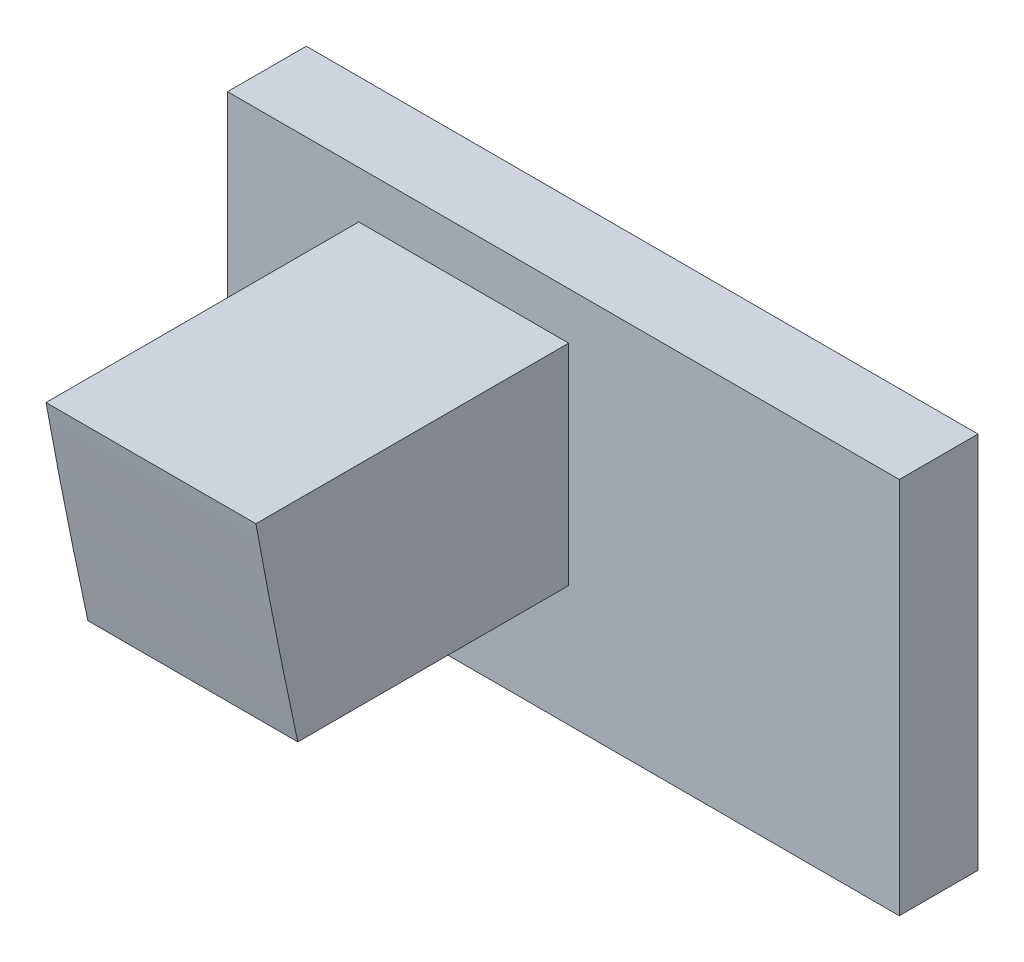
ISO-10303-21;
HEADER;
FILE_DESCRIPTION(('STEP AP214'),'2;1');
FILE_NAME('part.step','',(''),(''),'','','');
FILE_SCHEMA(('AUTOMOTIVE_DESIGN { 1 0 10303 214 1 1 1 1 }'));
ENDSEC;
DATA;
#1=APPLICATION_CONTEXT('core data for automotive mechanical design processes');
#2=APPLICATION_PROTOCOL_DEFINITION('international standard','automotive_design',2000,#1);
#3=PRODUCT_CONTEXT('',#1,'mechanical');
#4=PRODUCT('Part','Part','',(#3));
#5=PRODUCT_RELATED_PRODUCT_CATEGORY('part','',(#4));
#6=PRODUCT_DEFINITION_FORMATION('','',#4);
#7=PRODUCT_DEFINITION_CONTEXT('part definition',#1,'design');
#8=PRODUCT_DEFINITION('design','',#6,#7);
#9=PRODUCT_DEFINITION_SHAPE('','',#8);
#10=(LENGTH_UNIT() NAMED_UNIT(*) SI_UNIT(.MILLI.,.METRE.));
#11=(NAMED_UNIT(*) PLANE_ANGLE_UNIT() SI_UNIT($,.RADIAN.));
#12=(NAMED_UNIT(*) SI_UNIT($,.STERADIAN.) SOLID_ANGLE_UNIT());
#13=UNCERTAINTY_MEASURE_WITH_UNIT(LENGTH_MEASURE(1.E-05),#10,'distance_accuracy_value','');
#14=(GEOMETRIC_REPRESENTATION_CONTEXT(3) GLOBAL_UNCERTAINTY_ASSIGNED_CONTEXT((#13)) GLOBAL_UNIT_ASSIGNED_CONTEXT((#10,
#11,#12)) REPRESENTATION_CONTEXT('',''));
#15=CARTESIAN_POINT('',(0.,0.,0.));
#16=DIRECTION('',(0.,0.,1.));
#17=DIRECTION('',(1.,0.,0.));
#18=AXIS2_PLACEMENT_3D('',#15,#16,#17);
#19=CARTESIAN_POINT('',(0.,7.2,-500000.));
#20=DIRECTION('',(-1.,0.,0.));
#21=DIRECTION('',(0.,-1.,0.));
#22=AXIS2_PLACEMENT_3D('',#19,#20,#21);
#23=PLANE('',#22);
#24=DIRECTION('',(0.,0.,1.));
#25=VECTOR('',#24,1.);
#26=CARTESIAN_POINT('',(0.,0.,-500000.));
#27=LINE('',#26,#25);
#28=CARTESIAN_POINT('',(0.,0.,0.));
#29=VERTEX_POINT('',#28);
#30=CARTESIAN_POINT('',(0.,0.,1.49999999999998));
#31=VERTEX_POINT('',#30);
#32=EDGE_CURVE('E220',#29,#31,#27,.T.);
#33=ORIENTED_EDGE('',*,*,#32,.T.);
#34=DIRECTION('',(0.,1.,0.));
#35=VECTOR('',#34,1.);
#36=CARTESIAN_POINT('',(0.,7.2,1.49999999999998));
#37=LINE('',#36,#35);
#38=CARTESIAN_POINT('',(0.,7.2,1.49999999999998));
#39=VERTEX_POINT('',#38);
#40=EDGE_CURVE('E166',#31,#39,#37,.T.);
#41=ORIENTED_EDGE('',*,*,#40,.T.);
#42=DIRECTION('',(0.,0.,1.));
#43=VECTOR('',#42,1.);
#44=CARTESIAN_POINT('',(0.,7.2,-500000.));
#45=LINE('',#44,#43);
#46=CARTESIAN_POINT('',(0.,7.2,0.));
#47=VERTEX_POINT('',#46);
#48=EDGE_CURVE('E223',#47,#39,#45,.T.);
#49=ORIENTED_EDGE('',*,*,#48,.F.);
#50=DIRECTION('',(0.,1.,0.));
#51=VECTOR('',#50,1.);
#52=CARTESIAN_POINT('',(0.,7.2,0.));
#53=LINE('',#52,#51);
#54=EDGE_CURVE('E231',#29,#47,#53,.T.);
#55=ORIENTED_EDGE('',*,*,#54,.F.);
#56=EDGE_LOOP('',(#33,#41,#49,#55));
#57=FACE_BOUND('',#56,.T.);
#58=ADVANCED_FACE('F30',(#57),#23,.T.);
#59=CARTESIAN_POINT('',(0.,0.,-500000.));
#60=DIRECTION('',(0.,-1.,0.));
#61=DIRECTION('',(0.,0.,-1.));
#62=AXIS2_PLACEMENT_3D('',#59,#60,#61);
#63=PLANE('',#62);
#64=DIRECTION('',(0.,0.,1.));
#65=VECTOR('',#64,1.);
#66=CARTESIAN_POINT('',(12.8,0.,-500000.));
#67=LINE('',#66,#65);
#68=CARTESIAN_POINT('',(12.8,0.,0.));
#69=VERTEX_POINT('',#68);
#70=CARTESIAN_POINT('',(12.8,0.,1.50000000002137));
#71=VERTEX_POINT('',#70);
#72=EDGE_CURVE('E217',#69,#71,#67,.T.);
#73=ORIENTED_EDGE('',*,*,#72,.T.);
#74=DIRECTION('',(-1.,0.,0.));
#75=VECTOR('',#74,1.);
#76=CARTESIAN_POINT('',(0.,0.,1.49999999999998));
#77=LINE('',#76,#75);
#78=EDGE_CURVE('E169',#71,#31,#77,.T.);
#79=ORIENTED_EDGE('',*,*,#78,.T.);
#80=ORIENTED_EDGE('',*,*,#32,.F.);
#81=DIRECTION('',(-1.,0.,0.));
#82=VECTOR('',#81,1.);
#83=CARTESIAN_POINT('',(0.,0.,0.));
#84=LINE('',#83,#82);
#85=EDGE_CURVE('E229',#69,#29,#84,.T.);
#86=ORIENTED_EDGE('',*,*,#85,.F.);
#87=EDGE_LOOP('',(#73,#79,#80,#86));
#88=FACE_BOUND('',#87,.T.);
#89=ADVANCED_FACE('F245',(#88),#63,.T.);
#90=CARTESIAN_POINT('',(12.8,7.2,-500000.));
#91=DIRECTION('',(0.,1.,0.));
#92=DIRECTION('',(0.,0.,1.));
#93=AXIS2_PLACEMENT_3D('',#90,#91,#92);
#94=PLANE('',#93);
#95=ORIENTED_EDGE('',*,*,#48,.T.);
#96=DIRECTION('',(1.,0.,0.));
#97=VECTOR('',#96,1.);
#98=CARTESIAN_POINT('',(12.8,7.2,1.49999999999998));
#99=LINE('',#98,#97);
#100=CARTESIAN_POINT('',(12.8,7.2,1.49999999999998));
#101=VERTEX_POINT('',#100);
#102=EDGE_CURVE('E157',#39,#101,#99,.T.);
#103=ORIENTED_EDGE('',*,*,#102,.T.);
#104=DIRECTION('',(0.,0.,1.));
#105=VECTOR('',#104,1.);
#106=CARTESIAN_POINT('',(12.8,7.2,-500000.));
#107=LINE('',#106,#105);
#108=CARTESIAN_POINT('',(12.8,7.2,0.));
#109=VERTEX_POINT('',#108);
#110=EDGE_CURVE('E165',#109,#101,#107,.T.);
#111=ORIENTED_EDGE('',*,*,#110,.F.);
#112=DIRECTION('',(1.,0.,0.));
#113=VECTOR('',#112,1.);
#114=CARTESIAN_POINT('',(12.8,7.2,0.));
#115=LINE('',#114,#113);
#116=EDGE_CURVE('E226',#47,#109,#115,.T.);
#117=ORIENTED_EDGE('',*,*,#116,.F.);
#118=EDGE_LOOP('',(#95,#103,#111,#117));
#119=FACE_BOUND('',#118,.T.);
#120=ADVANCED_FACE('F32',(#119),#94,.T.);
#121=CARTESIAN_POINT('',(12.8,0.,-500000.));
#122=DIRECTION('',(1.,0.,0.));
#123=DIRECTION('',(0.,1.,0.));
#124=AXIS2_PLACEMENT_3D('',#121,#122,#123);
#125=PLANE('',#124);
#126=ORIENTED_EDGE('',*,*,#110,.T.);
#127=DIRECTION('',(0.,-1.,0.));
#128=VECTOR('',#127,1.);
#129=CARTESIAN_POINT('',(12.8,0.,1.49999999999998));
#130=LINE('',#129,#128);
#131=EDGE_CURVE('E162',#101,#71,#130,.T.);
#132=ORIENTED_EDGE('',*,*,#131,.T.);
#133=ORIENTED_EDGE('',*,*,#72,.F.);
#134=DIRECTION('',(0.,-1.,0.));
#135=VECTOR('',#134,1.);
#136=CARTESIAN_POINT('',(12.8,0.,0.));
#137=LINE('',#136,#135);
#138=EDGE_CURVE('E214',#109,#69,#137,.T.);
#139=ORIENTED_EDGE('',*,*,#138,.F.);
#140=EDGE_LOOP('',(#126,#132,#133,#139));
#141=FACE_BOUND('',#140,.T.);
#142=ADVANCED_FACE('F243',(#141),#125,.T.);
#143=CARTESIAN_POINT('',(0.,7.2,0.));
#144=DIRECTION('',(0.,0.,1.));
#145=DIRECTION('',(1.,0.,0.));
#146=AXIS2_PLACEMENT_3D('',#143,#144,#145);
#147=PLANE('',#146);
#148=ORIENTED_EDGE('',*,*,#54,.T.);
#149=ORIENTED_EDGE('',*,*,#116,.T.);
#150=ORIENTED_EDGE('',*,*,#138,.T.);
#151=ORIENTED_EDGE('',*,*,#85,.T.);
#152=EDGE_LOOP('',(#148,#149,#150,#151));
#153=FACE_BOUND('',#152,.T.);
#154=DIRECTION('',(-1.,0.,0.));
#155=VECTOR('',#154,1.);
#156=CARTESIAN_POINT('',(6.,2.8,0.));
#157=LINE('',#156,#155);
#158=CARTESIAN_POINT('',(6.,2.8,0.));
#159=VERTEX_POINT('',#158);
#160=CARTESIAN_POINT('',(3.,2.8,0.));
#161=VERTEX_POINT('',#160);
#162=EDGE_CURVE('E38',#159,#161,#157,.T.);
#163=ORIENTED_EDGE('',*,*,#162,.F.);
#164=DIRECTION('',(0.,1.,0.));
#165=VECTOR('',#164,1.);
#166=CARTESIAN_POINT('',(6.,2.8,0.));
#167=LINE('',#166,#165);
#168=CARTESIAN_POINT('',(6.,5.8,0.));
#169=VERTEX_POINT('',#168);
#170=EDGE_CURVE('E187',#159,#169,#167,.T.);
#171=ORIENTED_EDGE('',*,*,#170,.T.);
#172=DIRECTION('',(1.,0.,0.));
#173=VECTOR('',#172,1.);
#174=CARTESIAN_POINT('',(3.,5.8,0.));
#175=LINE('',#174,#173);
#176=CARTESIAN_POINT('',(3.,5.8,0.));
#177=VERTEX_POINT('',#176);
#178=EDGE_CURVE('E185',#177,#169,#175,.T.);
#179=ORIENTED_EDGE('',*,*,#178,.F.);
#180=DIRECTION('',(0.,-1.,0.));
#181=VECTOR('',#180,1.);
#182=CARTESIAN_POINT('',(3.,5.8,0.));
#183=LINE('',#182,#181);
#184=EDGE_CURVE('E182',#177,#161,#183,.T.);
#185=ORIENTED_EDGE('',*,*,#184,.T.);
#186=EDGE_LOOP('',(#163,#171,#179,#185));
#187=FACE_BOUND('',#186,.T.);
#188=ADVANCED_FACE('F236',(#153,#187),#147,.F.);
#189=CARTESIAN_POINT('',(6.,2.8,4.49999999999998));
#190=DIRECTION('',(0.,-1.,0.));
#191=DIRECTION('',(1.,0.,0.));
#192=AXIS2_PLACEMENT_3D('',#189,#190,#191);
#193=PLANE('',#192);
#194=ORIENTED_EDGE('',*,*,#162,.T.);
#195=DIRECTION('',(0.,0.,-1.));
#196=VECTOR('',#195,1.);
#197=CARTESIAN_POINT('',(3.,2.8,4.49999999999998));
#198=LINE('',#197,#196);
#199=CARTESIAN_POINT('',(3.,2.8,4.49999999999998));
#200=VERTEX_POINT('',#199);
#201=EDGE_CURVE('E196',#200,#161,#198,.T.);
#202=ORIENTED_EDGE('',*,*,#201,.F.);
#203=DIRECTION('',(-1.,0.,0.));
#204=VECTOR('',#203,1.);
#205=CARTESIAN_POINT('',(6.,2.8,4.49999999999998));
#206=LINE('',#205,#204);
#207=CARTESIAN_POINT('',(6.,2.8,4.49999999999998));
#208=VERTEX_POINT('',#207);
#209=EDGE_CURVE('E193',#208,#200,#206,.T.);
#210=ORIENTED_EDGE('',*,*,#209,.F.);
#211=DIRECTION('',(0.,0.,-1.));
#212=VECTOR('',#211,1.);
#213=CARTESIAN_POINT('',(6.,2.8,4.49999999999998));
#214=LINE('',#213,#212);
#215=EDGE_CURVE('E190',#208,#159,#214,.T.);
#216=ORIENTED_EDGE('',*,*,#215,.T.);
#217=EDGE_LOOP('',(#194,#202,#210,#216));
#218=FACE_BOUND('',#217,.T.);
#219=ADVANCED_FACE('F280',(#218),#193,.F.);
#220=CARTESIAN_POINT('',(3.,5.8,4.49999999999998));
#221=DIRECTION('',(1.,0.,0.));
#222=DIRECTION('',(0.,1.,0.));
#223=AXIS2_PLACEMENT_3D('',#220,#221,#222);
#224=PLANE('',#223);
#225=ORIENTED_EDGE('',*,*,#184,.F.);
#226=DIRECTION('',(0.,0.,-1.));
#227=VECTOR('',#226,1.);
#228=CARTESIAN_POINT('',(3.,5.8,4.49999999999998));
#229=LINE('',#228,#227);
#230=CARTESIAN_POINT('',(3.,5.8,4.49999999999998));
#231=VERTEX_POINT('',#230);
#232=EDGE_CURVE('E205',#231,#177,#229,.T.);
#233=ORIENTED_EDGE('',*,*,#232,.F.);
#234=DIRECTION('',(0.,-1.,0.));
#235=VECTOR('',#234,1.);
#236=CARTESIAN_POINT('',(3.,5.8,4.49999999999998));
#237=LINE('',#236,#235);
#238=EDGE_CURVE('E211',#231,#200,#237,.T.);
#239=ORIENTED_EDGE('',*,*,#238,.T.);
#240=ORIENTED_EDGE('',*,*,#201,.T.);
#241=EDGE_LOOP('',(#225,#233,#239,#240));
#242=FACE_BOUND('',#241,.T.);
#243=ADVANCED_FACE('F276',(#242),#224,.T.);
#244=CARTESIAN_POINT('',(3.,5.8,4.49999999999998));
#245=DIRECTION('',(0.,1.,0.));
#246=DIRECTION('',(0.,0.,1.));
#247=AXIS2_PLACEMENT_3D('',#244,#245,#246);
#248=PLANE('',#247);
#249=ORIENTED_EDGE('',*,*,#178,.T.);
#250=DIRECTION('',(0.,0.,-1.));
#251=VECTOR('',#250,1.);
#252=CARTESIAN_POINT('',(6.,5.8,4.49999999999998));
#253=LINE('',#252,#251);
#254=CARTESIAN_POINT('',(6.,5.8,4.49999999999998));
#255=VERTEX_POINT('',#254);
#256=EDGE_CURVE('E199',#255,#169,#253,.T.);
#257=ORIENTED_EDGE('',*,*,#256,.F.);
#258=DIRECTION('',(1.,0.,0.));
#259=VECTOR('',#258,1.);
#260=CARTESIAN_POINT('',(3.,5.8,4.49999999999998));
#261=LINE('',#260,#259);
#262=EDGE_CURVE('E208',#231,#255,#261,.T.);
#263=ORIENTED_EDGE('',*,*,#262,.F.);
#264=ORIENTED_EDGE('',*,*,#232,.T.);
#265=EDGE_LOOP('',(#249,#257,#263,#264));
#266=FACE_BOUND('',#265,.T.);
#267=ADVANCED_FACE('F279',(#266),#248,.F.);
#268=CARTESIAN_POINT('',(6.,2.8,4.49999999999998));
#269=DIRECTION('',(-1.,0.,0.));
#270=DIRECTION('',(0.,0.,1.));
#271=AXIS2_PLACEMENT_3D('',#268,#269,#270);
#272=PLANE('',#271);
#273=ORIENTED_EDGE('',*,*,#170,.F.);
#274=ORIENTED_EDGE('',*,*,#215,.F.);
#275=DIRECTION('',(0.,1.,0.));
#276=VECTOR('',#275,1.);
#277=CARTESIAN_POINT('',(6.,2.8,4.49999999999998));
#278=LINE('',#277,#276);
#279=EDGE_CURVE('E202',#208,#255,#278,.T.);
#280=ORIENTED_EDGE('',*,*,#279,.T.);
#281=ORIENTED_EDGE('',*,*,#256,.T.);
#282=EDGE_LOOP('',(#273,#274,#280,#281));
#283=FACE_BOUND('',#282,.T.);
#284=ADVANCED_FACE('F274',(#283),#272,.T.);
#285=CARTESIAN_POINT('',(3.,5.8,4.49999999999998));
#286=DIRECTION('',(0.,0.,1.));
#287=DIRECTION('',(1.,0.,0.));
#288=AXIS2_PLACEMENT_3D('',#285,#286,#287);
#289=PLANE('',#288);
#290=ORIENTED_EDGE('',*,*,#238,.F.);
#291=ORIENTED_EDGE('',*,*,#262,.T.);
#292=ORIENTED_EDGE('',*,*,#279,.F.);
#293=ORIENTED_EDGE('',*,*,#209,.T.);
#294=EDGE_LOOP('',(#290,#291,#292,#293));
#295=FACE_BOUND('',#294,.T.);
#296=ADVANCED_FACE('F262',(#295),#289,.F.);
#297=CARTESIAN_POINT('',(6.5,2.3,-14.6860478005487));
#298=DIRECTION('',(1.,0.,0.));
#299=DIRECTION('',(0.,0.,-1.));
#300=AXIS2_PLACEMENT_3D('',#297,#298,#299);
#301=PLANE('',#300);
#302=CARTESIAN_POINT('',(6.5,7.50886043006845,7.67312505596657));
#303=CARTESIAN_POINT('',(6.5,6.24791784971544,7.45785822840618));
#304=CARTESIAN_POINT('',(6.5,4.99256298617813,7.22033069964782));
#305=CARTESIAN_POINT('',(6.5,3.11653169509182,6.83653086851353));
#306=CARTESIAN_POINT('',(6.5,2.49345626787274,6.70422354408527));
#307=CARTESIAN_POINT('',(6.5,1.24729385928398,6.43251644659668));
#308=CARTESIAN_POINT('',(6.5,0.628090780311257,6.29330000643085));
#309=CARTESIAN_POINT('',(6.5,0.0115766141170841,6.15659063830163));
#310=B_SPLINE_CURVE_WITH_KNOTS('',3,(#302,#303,#304,#305,#306,#307,#308,#309),.UNSPECIFIED.,.F.,
.F.,(4,2,2,4),(0.,0.5,0.75,1.),.UNSPECIFIED.);
#311=CARTESIAN_POINT('',(6.5,2.29999999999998,6.66146549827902));
#312=VERTEX_POINT('',#311);
#313=CARTESIAN_POINT('',(6.5,6.3,7.45975127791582));
#314=VERTEX_POINT('',#313);
#315=EDGE_CURVE('E130',#312,#314,#310,.F.);
#316=ORIENTED_EDGE('',*,*,#315,.F.);
#317=DIRECTION('',(0.,0.,1.));
#318=VECTOR('',#317,1.);
#319=CARTESIAN_POINT('',(6.5,2.3,-14.6860478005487));
#320=LINE('',#319,#318);
#321=CARTESIAN_POINT('',(6.5,2.3,1.49999999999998));
#322=VERTEX_POINT('',#321);
#323=EDGE_CURVE('E121',#322,#312,#320,.T.);
#324=ORIENTED_EDGE('',*,*,#323,.F.);
#325=DIRECTION('',(0.,-1.,0.));
#326=VECTOR('',#325,1.);
#327=CARTESIAN_POINT('',(6.5,2.3,1.49999999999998));
#328=LINE('',#327,#326);
#329=CARTESIAN_POINT('',(6.5,6.3,1.49999999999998));
#330=VERTEX_POINT('',#329);
#331=EDGE_CURVE('E170',#330,#322,#328,.T.);
#332=ORIENTED_EDGE('',*,*,#331,.F.);
#333=DIRECTION('',(0.,0.,1.));
#334=VECTOR('',#333,1.);
#335=CARTESIAN_POINT('',(6.5,6.3,-14.6860478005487));
#336=LINE('',#335,#334);
#337=EDGE_CURVE('E129',#330,#314,#336,.T.);
#338=ORIENTED_EDGE('',*,*,#337,.T.);
#339=EDGE_LOOP('',(#316,#324,#332,#338));
#340=FACE_BOUND('',#339,.T.);
#341=ADVANCED_FACE('F133',(#340),#301,.T.);
#342=CARTESIAN_POINT('',(6.5,6.3,-14.6860478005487));
#343=DIRECTION('',(0.,1.,0.));
#344=DIRECTION('',(0.,0.,1.));
#345=AXIS2_PLACEMENT_3D('',#342,#343,#344);
#346=PLANE('',#345);
#347=DIRECTION('',(-1.,0.,0.));
#348=VECTOR('',#347,1.);
#349=CARTESIAN_POINT('',(35.2378752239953,6.3,7.45975127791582));
#350=LINE('',#349,#348);
#351=CARTESIAN_POINT('',(2.5,6.3,7.45975127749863));
#352=VERTEX_POINT('',#351);
#353=EDGE_CURVE('E45',#314,#352,#350,.T.);
#354=ORIENTED_EDGE('',*,*,#353,.F.);
#355=ORIENTED_EDGE('',*,*,#337,.F.);
#356=DIRECTION('',(1.,0.,0.));
#357=VECTOR('',#356,1.);
#358=CARTESIAN_POINT('',(6.5,6.3,1.49999999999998));
#359=LINE('',#358,#357);
#360=CARTESIAN_POINT('',(2.5,6.3,1.49999999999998));
#361=VERTEX_POINT('',#360);
#362=EDGE_CURVE('E151',#361,#330,#359,.T.);
#363=ORIENTED_EDGE('',*,*,#362,.F.);
#364=DIRECTION('',(0.,0.,1.));
#365=VECTOR('',#364,1.);
#366=CARTESIAN_POINT('',(2.5,6.3,-14.6860478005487));
#367=LINE('',#366,#365);
#368=EDGE_CURVE('E177',#361,#352,#367,.T.);
#369=ORIENTED_EDGE('',*,*,#368,.T.);
#370=EDGE_LOOP('',(#354,#355,#363,#369));
#371=FACE_BOUND('',#370,.T.);
#372=ADVANCED_FACE('F253',(#371),#346,.T.);
#373=CARTESIAN_POINT('',(2.5,6.3,-14.6860478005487));
#374=DIRECTION('',(-1.,0.,0.));
#375=DIRECTION('',(0.,-1.,0.));
#376=AXIS2_PLACEMENT_3D('',#373,#374,#375);
#377=PLANE('',#376);
#378=CARTESIAN_POINT('',(2.5,7.50886043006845,7.67312505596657));
#379=CARTESIAN_POINT('',(2.5,6.24791784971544,7.45785822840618));
#380=CARTESIAN_POINT('',(2.5,4.99256298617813,7.22033069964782));
#381=CARTESIAN_POINT('',(2.5,3.11653169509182,6.83653086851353));
#382=CARTESIAN_POINT('',(2.5,2.49345626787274,6.70422354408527));
#383=CARTESIAN_POINT('',(2.5,1.24729385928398,6.43251644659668));
#384=CARTESIAN_POINT('',(2.5,0.628090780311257,6.29330000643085));
#385=CARTESIAN_POINT('',(2.5,0.0115766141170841,6.15659063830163));
#386=B_SPLINE_CURVE_WITH_KNOTS('',3,(#378,#379,#380,#381,#382,#383,#384,#385),.UNSPECIFIED.,.F.,
.F.,(4,2,2,4),(0.,0.5,0.75,1.),.UNSPECIFIED.);
#387=CARTESIAN_POINT('',(2.5,2.3,6.66146549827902));
#388=VERTEX_POINT('',#387);
#389=EDGE_CURVE('E53',#352,#388,#386,.T.);
#390=ORIENTED_EDGE('',*,*,#389,.F.);
#391=ORIENTED_EDGE('',*,*,#368,.F.);
#392=DIRECTION('',(0.,1.,0.));
#393=VECTOR('',#392,1.);
#394=CARTESIAN_POINT('',(2.5,6.3,1.49999999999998));
#395=LINE('',#394,#393);
#396=CARTESIAN_POINT('',(2.5,2.3,1.49999999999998));
#397=VERTEX_POINT('',#396);
#398=EDGE_CURVE('E158',#397,#361,#395,.T.);
#399=ORIENTED_EDGE('',*,*,#398,.F.);
#400=DIRECTION('',(0.,0.,1.));
#401=VECTOR('',#400,1.);
#402=CARTESIAN_POINT('',(2.5,2.3,-14.6860478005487));
#403=LINE('',#402,#401);
#404=EDGE_CURVE('E175',#397,#388,#403,.T.);
#405=ORIENTED_EDGE('',*,*,#404,.T.);
#406=EDGE_LOOP('',(#390,#391,#399,#405));
#407=FACE_BOUND('',#406,.T.);
#408=ADVANCED_FACE('F255',(#407),#377,.T.);
#409=CARTESIAN_POINT('',(2.5,2.3,-14.6860478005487));
#410=DIRECTION('',(0.,-1.,0.));
#411=DIRECTION('',(1.,0.,0.));
#412=AXIS2_PLACEMENT_3D('',#409,#410,#411);
#413=PLANE('',#412);
#414=DIRECTION('',(-1.,0.,0.));
#415=VECTOR('',#414,1.);
#416=CARTESIAN_POINT('',(35.2378752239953,2.29999999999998,6.66146549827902));
#417=LINE('',#416,#415);
#418=EDGE_CURVE('E12',#388,#312,#417,.F.);
#419=ORIENTED_EDGE('',*,*,#418,.F.);
#420=ORIENTED_EDGE('',*,*,#404,.F.);
#421=DIRECTION('',(-1.,0.,0.));
#422=VECTOR('',#421,1.);
#423=CARTESIAN_POINT('',(2.5,2.3,1.49999999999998));
#424=LINE('',#423,#422);
#425=EDGE_CURVE('E126',#322,#397,#424,.T.);
#426=ORIENTED_EDGE('',*,*,#425,.F.);
#427=ORIENTED_EDGE('',*,*,#323,.T.);
#428=EDGE_LOOP('',(#419,#420,#426,#427));
#429=FACE_BOUND('',#428,.T.);
#430=ADVANCED_FACE('F123',(#429),#413,.T.);
#431=CARTESIAN_POINT('',(0.,7.2,1.49999999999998));
#432=DIRECTION('',(0.,0.,1.));
#433=DIRECTION('',(1.,0.,0.));
#434=AXIS2_PLACEMENT_3D('',#431,#432,#433);
#435=PLANE('',#434);
#436=ORIENTED_EDGE('',*,*,#131,.F.);
#437=ORIENTED_EDGE('',*,*,#102,.F.);
#438=ORIENTED_EDGE('',*,*,#40,.F.);
#439=ORIENTED_EDGE('',*,*,#78,.F.);
#440=EDGE_LOOP('',(#436,#437,#438,#439));
#441=FACE_BOUND('',#440,.T.);
#442=ORIENTED_EDGE('',*,*,#331,.T.);
#443=ORIENTED_EDGE('',*,*,#425,.T.);
#444=ORIENTED_EDGE('',*,*,#398,.T.);
#445=ORIENTED_EDGE('',*,*,#362,.T.);
#446=EDGE_LOOP('',(#442,#443,#444,#445));
#447=FACE_BOUND('',#446,.T.);
#448=ADVANCED_FACE('F249',(#441,#447),#435,.T.);
#449=CARTESIAN_POINT('',(35.2378752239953,7.50886043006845,7.67312505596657));
#450=CARTESIAN_POINT('',(35.2378752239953,6.24791784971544,7.45785822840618));
#451=CARTESIAN_POINT('',(35.2378752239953,4.99256298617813,7.22033069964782));
#452=CARTESIAN_POINT('',(35.2378752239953,3.11653169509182,6.83653086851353));
#453=CARTESIAN_POINT('',(35.2378752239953,2.49345626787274,6.70422354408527));
#454=CARTESIAN_POINT('',(35.2378752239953,1.24729385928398,6.43251644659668));
#455=CARTESIAN_POINT('',(35.2378752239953,0.628090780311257,6.29330000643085));
#456=CARTESIAN_POINT('',(35.2378752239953,0.0115766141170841,6.15659063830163));
#457=B_SPLINE_CURVE_WITH_KNOTS('',3,(#449,#450,#451,#452,#453,#454,#455,#456),.UNSPECIFIED.,.F.,
.F.,(4,2,2,4),(0.,0.5,0.75,1.),.UNSPECIFIED.);
#458=DIRECTION('',(-1.,0.,0.));
#459=VECTOR('',#458,1.);
#460=SURFACE_OF_LINEAR_EXTRUSION('',#457,#459);
#461=ORIENTED_EDGE('',*,*,#418,.T.);
#462=ORIENTED_EDGE('',*,*,#315,.T.);
#463=ORIENTED_EDGE('',*,*,#353,.T.);
#464=ORIENTED_EDGE('',*,*,#389,.T.);
#465=EDGE_LOOP('',(#461,#462,#463,#464));
#466=FACE_BOUND('',#465,.T.);
#467=ADVANCED_FACE('F136',(#466),#460,.F.);
#468=CLOSED_SHELL('',(#58,#89,#120,#142,#188,#219,#243,#267,#284,#296,#341,#372,#408,#430,#448,#467));
#469=MANIFOLD_SOLID_BREP('B2',#468);
#470=ADVANCED_BREP_SHAPE_REPRESENTATION('',(#18,#469),#14);
#471=SHAPE_DEFINITION_REPRESENTATION(#9,#470);
ENDSEC;
END-ISO-10303-21;
